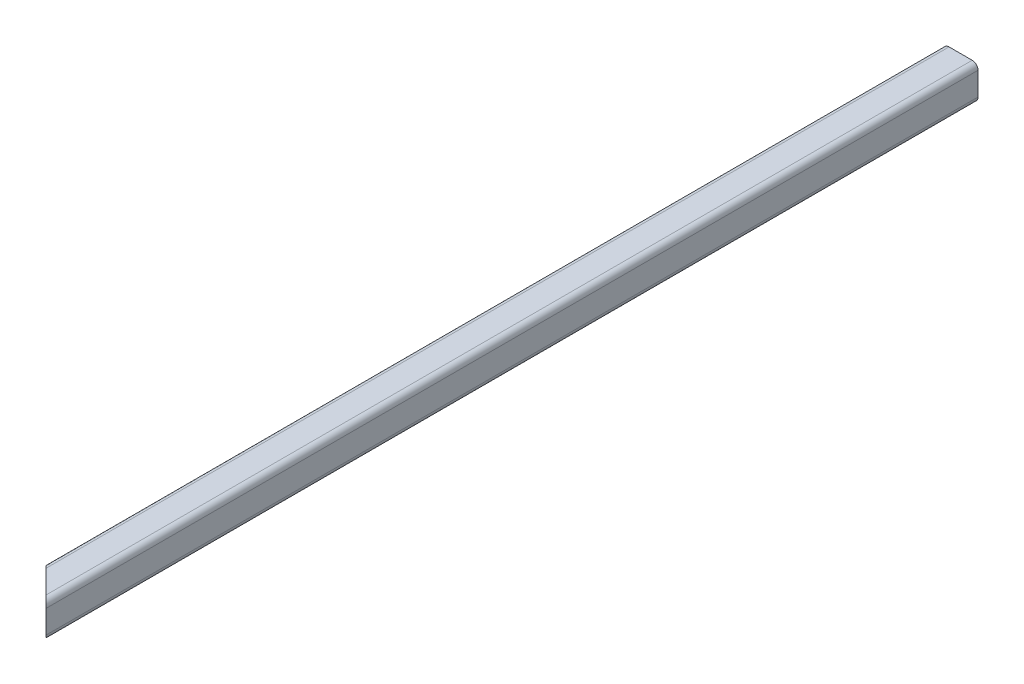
ISO-10303-21;
HEADER;
FILE_DESCRIPTION(('STEP AP214'),'2;1');
FILE_NAME('part.step','',(''),(''),'','','');
FILE_SCHEMA(('AUTOMOTIVE_DESIGN { 1 0 10303 214 1 1 1 1 }'));
ENDSEC;
DATA;
#1=APPLICATION_CONTEXT('core data for automotive mechanical design processes');
#2=APPLICATION_PROTOCOL_DEFINITION('international standard','automotive_design',2000,#1);
#3=PRODUCT_CONTEXT('',#1,'mechanical');
#4=PRODUCT('Part','Part','',(#3));
#5=PRODUCT_RELATED_PRODUCT_CATEGORY('part','',(#4));
#6=PRODUCT_DEFINITION_FORMATION('','',#4);
#7=PRODUCT_DEFINITION_CONTEXT('part definition',#1,'design');
#8=PRODUCT_DEFINITION('design','',#6,#7);
#9=PRODUCT_DEFINITION_SHAPE('','',#8);
#10=(LENGTH_UNIT() NAMED_UNIT(*) SI_UNIT(.MILLI.,.METRE.));
#11=(NAMED_UNIT(*) PLANE_ANGLE_UNIT() SI_UNIT($,.RADIAN.));
#12=(NAMED_UNIT(*) SI_UNIT($,.STERADIAN.) SOLID_ANGLE_UNIT());
#13=UNCERTAINTY_MEASURE_WITH_UNIT(LENGTH_MEASURE(1.E-05),#10,'distance_accuracy_value','');
#14=(GEOMETRIC_REPRESENTATION_CONTEXT(3) GLOBAL_UNCERTAINTY_ASSIGNED_CONTEXT((#13)) GLOBAL_UNIT_ASSIGNED_CONTEXT((#10,
#11,#12)) REPRESENTATION_CONTEXT('',''));
#15=CARTESIAN_POINT('',(0.,0.,0.));
#16=DIRECTION('',(0.,0.,1.));
#17=DIRECTION('',(1.,0.,0.));
#18=AXIS2_PLACEMENT_3D('',#15,#16,#17);
#19=CARTESIAN_POINT('',(20.,20.,0.));
#20=DIRECTION('',(0.,0.,1.));
#21=DIRECTION('',(1.,0.,0.));
#22=AXIS2_PLACEMENT_3D('',#19,#20,#21);
#23=PLANE('',#22);
#24=CARTESIAN_POINT('',(20.,20.,0.));
#25=DIRECTION('',(0.,0.,1.));
#26=DIRECTION('',(1.,0.,0.));
#27=AXIS2_PLACEMENT_3D('',#24,#25,#26);
#28=CIRCLE('',#27,10.);
#29=CARTESIAN_POINT('',(30.,20.,0.));
#30=VERTEX_POINT('',#29);
#31=CARTESIAN_POINT('',(20.,30.,0.));
#32=VERTEX_POINT('',#31);
#33=EDGE_CURVE('E193',#30,#32,#28,.T.);
#34=ORIENTED_EDGE('',*,*,#33,.F.);
#35=DIRECTION('',(0.,1.,0.));
#36=VECTOR('',#35,1.);
#37=CARTESIAN_POINT('',(30.,20.,0.));
#38=LINE('',#37,#36);
#39=CARTESIAN_POINT('',(30.,-20.,0.));
#40=VERTEX_POINT('',#39);
#41=EDGE_CURVE('E156',#40,#30,#38,.T.);
#42=ORIENTED_EDGE('',*,*,#41,.F.);
#43=CARTESIAN_POINT('',(20.,-20.,0.));
#44=DIRECTION('',(0.,0.,1.));
#45=DIRECTION('',(1.,0.,0.));
#46=AXIS2_PLACEMENT_3D('',#43,#44,#45);
#47=CIRCLE('',#46,10.);
#48=CARTESIAN_POINT('',(20.,-30.,0.));
#49=VERTEX_POINT('',#48);
#50=EDGE_CURVE('E212',#49,#40,#47,.T.);
#51=ORIENTED_EDGE('',*,*,#50,.F.);
#52=DIRECTION('',(1.,0.,0.));
#53=VECTOR('',#52,1.);
#54=CARTESIAN_POINT('',(-20.,-30.,0.));
#55=LINE('',#54,#53);
#56=CARTESIAN_POINT('',(-20.,-30.,0.));
#57=VERTEX_POINT('',#56);
#58=EDGE_CURVE('E210',#57,#49,#55,.T.);
#59=ORIENTED_EDGE('',*,*,#58,.F.);
#60=CARTESIAN_POINT('',(-20.,-20.,0.));
#61=DIRECTION('',(0.,0.,1.));
#62=DIRECTION('',(1.,0.,0.));
#63=AXIS2_PLACEMENT_3D('',#60,#61,#62);
#64=CIRCLE('',#63,10.);
#65=CARTESIAN_POINT('',(-30.,-20.,0.));
#66=VERTEX_POINT('',#65);
#67=EDGE_CURVE('E207',#66,#57,#64,.T.);
#68=ORIENTED_EDGE('',*,*,#67,.F.);
#69=DIRECTION('',(0.,-1.,0.));
#70=VECTOR('',#69,1.);
#71=CARTESIAN_POINT('',(-30.,-20.,0.));
#72=LINE('',#71,#70);
#73=CARTESIAN_POINT('',(-30.,20.,0.));
#74=VERTEX_POINT('',#73);
#75=EDGE_CURVE('E204',#74,#66,#72,.T.);
#76=ORIENTED_EDGE('',*,*,#75,.F.);
#77=CARTESIAN_POINT('',(-20.,20.,0.));
#78=DIRECTION('',(0.,0.,1.));
#79=DIRECTION('',(1.,0.,0.));
#80=AXIS2_PLACEMENT_3D('',#77,#78,#79);
#81=CIRCLE('',#80,10.);
#82=CARTESIAN_POINT('',(-20.,30.,0.));
#83=VERTEX_POINT('',#82);
#84=EDGE_CURVE('E196',#83,#74,#81,.T.);
#85=ORIENTED_EDGE('',*,*,#84,.F.);
#86=DIRECTION('',(-1.,0.,0.));
#87=VECTOR('',#86,1.);
#88=CARTESIAN_POINT('',(20.,30.,0.));
#89=LINE('',#88,#87);
#90=EDGE_CURVE('E188',#32,#83,#89,.T.);
#91=ORIENTED_EDGE('',*,*,#90,.F.);
#92=EDGE_LOOP('',(#34,#42,#51,#59,#68,#76,#85,#91));
#93=FACE_BOUND('',#92,.T.);
#94=CARTESIAN_POINT('',(-20.,20.,0.));
#95=DIRECTION('',(0.,0.,1.));
#96=DIRECTION('',(1.,0.,0.));
#97=AXIS2_PLACEMENT_3D('',#94,#95,#96);
#98=CIRCLE('',#97,5.00000000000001);
#99=CARTESIAN_POINT('',(-20.,25.,0.));
#100=VERTEX_POINT('',#99);
#101=CARTESIAN_POINT('',(-25.,20.,0.));
#102=VERTEX_POINT('',#101);
#103=EDGE_CURVE('E163',#100,#102,#98,.T.);
#104=ORIENTED_EDGE('',*,*,#103,.T.);
#105=DIRECTION('',(0.,-1.,0.));
#106=VECTOR('',#105,1.);
#107=CARTESIAN_POINT('',(-25.,-20.,0.));
#108=LINE('',#107,#106);
#109=CARTESIAN_POINT('',(-25.,-20.,0.));
#110=VERTEX_POINT('',#109);
#111=EDGE_CURVE('E243',#102,#110,#108,.T.);
#112=ORIENTED_EDGE('',*,*,#111,.T.);
#113=CARTESIAN_POINT('',(-20.,-20.,0.));
#114=DIRECTION('',(0.,0.,1.));
#115=DIRECTION('',(1.,0.,0.));
#116=AXIS2_PLACEMENT_3D('',#113,#114,#115);
#117=CIRCLE('',#116,5.);
#118=CARTESIAN_POINT('',(-20.,-25.,0.));
#119=VERTEX_POINT('',#118);
#120=EDGE_CURVE('E246',#110,#119,#117,.T.);
#121=ORIENTED_EDGE('',*,*,#120,.T.);
#122=DIRECTION('',(1.,0.,0.));
#123=VECTOR('',#122,1.);
#124=CARTESIAN_POINT('',(-20.,-25.,0.));
#125=LINE('',#124,#123);
#126=CARTESIAN_POINT('',(20.,-25.,0.));
#127=VERTEX_POINT('',#126);
#128=EDGE_CURVE('E249',#119,#127,#125,.T.);
#129=ORIENTED_EDGE('',*,*,#128,.T.);
#130=CARTESIAN_POINT('',(20.,-20.,0.));
#131=DIRECTION('',(0.,0.,1.));
#132=DIRECTION('',(1.,0.,0.));
#133=AXIS2_PLACEMENT_3D('',#130,#131,#132);
#134=CIRCLE('',#133,5.00000000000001);
#135=CARTESIAN_POINT('',(25.,-20.,0.));
#136=VERTEX_POINT('',#135);
#137=EDGE_CURVE('E252',#127,#136,#134,.T.);
#138=ORIENTED_EDGE('',*,*,#137,.T.);
#139=DIRECTION('',(0.,1.,0.));
#140=VECTOR('',#139,1.);
#141=CARTESIAN_POINT('',(25.,20.,0.));
#142=LINE('',#141,#140);
#143=CARTESIAN_POINT('',(25.,20.,0.));
#144=VERTEX_POINT('',#143);
#145=EDGE_CURVE('E255',#136,#144,#142,.T.);
#146=ORIENTED_EDGE('',*,*,#145,.T.);
#147=CARTESIAN_POINT('',(20.,20.,0.));
#148=DIRECTION('',(0.,0.,1.));
#149=DIRECTION('',(1.,0.,0.));
#150=AXIS2_PLACEMENT_3D('',#147,#148,#149);
#151=CIRCLE('',#150,5.00000000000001);
#152=CARTESIAN_POINT('',(20.,25.,0.));
#153=VERTEX_POINT('',#152);
#154=EDGE_CURVE('E258',#144,#153,#151,.T.);
#155=ORIENTED_EDGE('',*,*,#154,.T.);
#156=DIRECTION('',(-1.,0.,0.));
#157=VECTOR('',#156,1.);
#158=CARTESIAN_POINT('',(20.,25.,0.));
#159=LINE('',#158,#157);
#160=EDGE_CURVE('E261',#153,#100,#159,.T.);
#161=ORIENTED_EDGE('',*,*,#160,.T.);
#162=EDGE_LOOP('',(#104,#112,#121,#129,#138,#146,#155,#161));
#163=FACE_BOUND('',#162,.T.);
#164=ADVANCED_FACE('F32',(#93,#163),#23,.F.);
#165=CARTESIAN_POINT('',(20.,20.,1610.));
#166=DIRECTION('',(0.,0.,-1.));
#167=DIRECTION('',(-1.,0.,0.));
#168=AXIS2_PLACEMENT_3D('',#165,#166,#167);
#169=CYLINDRICAL_SURFACE('',#168,10.);
#170=DIRECTION('',(0.,0.,-1.));
#171=VECTOR('',#170,1.);
#172=CARTESIAN_POINT('',(20.,30.,1610.));
#173=LINE('',#172,#171);
#174=CARTESIAN_POINT('',(20.0000000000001,30.,1600.));
#175=VERTEX_POINT('',#174);
#176=EDGE_CURVE('E40',#175,#32,#173,.T.);
#177=ORIENTED_EDGE('',*,*,#176,.F.);
#178=CARTESIAN_POINT('',(20.,20.,1600.));
#179=DIRECTION('',(0.707106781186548,0.,-0.707106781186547));
#180=DIRECTION('',(-0.707106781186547,0.,-0.707106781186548));
#181=AXIS2_PLACEMENT_3D('',#178,#179,#180);
#182=ELLIPSE('',#181,14.142135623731,10.);
#183=CARTESIAN_POINT('',(30.,20.,1610.));
#184=VERTEX_POINT('',#183);
#185=EDGE_CURVE('E147',#175,#184,#182,.T.);
#186=ORIENTED_EDGE('',*,*,#185,.T.);
#187=DIRECTION('',(0.,0.,-1.));
#188=VECTOR('',#187,1.);
#189=CARTESIAN_POINT('',(30.,20.,1610.));
#190=LINE('',#189,#188);
#191=EDGE_CURVE('E155',#184,#30,#190,.T.);
#192=ORIENTED_EDGE('',*,*,#191,.T.);
#193=ORIENTED_EDGE('',*,*,#33,.T.);
#194=EDGE_LOOP('',(#177,#186,#192,#193));
#195=FACE_BOUND('',#194,.T.);
#196=ADVANCED_FACE('F34',(#195),#169,.T.);
#197=CARTESIAN_POINT('',(20.,30.,1610.));
#198=DIRECTION('',(0.,-1.,0.));
#199=DIRECTION('',(1.,0.,0.));
#200=AXIS2_PLACEMENT_3D('',#197,#198,#199);
#201=PLANE('',#200);
#202=DIRECTION('',(0.,0.,-1.));
#203=VECTOR('',#202,1.);
#204=CARTESIAN_POINT('',(-20.,30.,1610.));
#205=LINE('',#204,#203);
#206=CARTESIAN_POINT('',(-20.,30.,1560.));
#207=VERTEX_POINT('',#206);
#208=EDGE_CURVE('E182',#207,#83,#205,.T.);
#209=ORIENTED_EDGE('',*,*,#208,.F.);
#210=DIRECTION('',(-0.707106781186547,0.,-0.707106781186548));
#211=VECTOR('',#210,1.);
#212=CARTESIAN_POINT('',(-30.,30.,1550.));
#213=LINE('',#212,#211);
#214=EDGE_CURVE('E190',#175,#207,#213,.T.);
#215=ORIENTED_EDGE('',*,*,#214,.F.);
#216=ORIENTED_EDGE('',*,*,#176,.T.);
#217=ORIENTED_EDGE('',*,*,#90,.T.);
#218=EDGE_LOOP('',(#209,#215,#216,#217));
#219=FACE_BOUND('',#218,.T.);
#220=ADVANCED_FACE('F187',(#219),#201,.F.);
#221=CARTESIAN_POINT('',(-20.,20.,1610.));
#222=DIRECTION('',(0.,0.,-1.));
#223=DIRECTION('',(-1.,0.,0.));
#224=AXIS2_PLACEMENT_3D('',#221,#222,#223);
#225=CYLINDRICAL_SURFACE('',#224,10.);
#226=DIRECTION('',(0.,0.,-1.));
#227=VECTOR('',#226,1.);
#228=CARTESIAN_POINT('',(-30.,20.,1610.));
#229=LINE('',#228,#227);
#230=CARTESIAN_POINT('',(-30.,20.,1550.));
#231=VERTEX_POINT('',#230);
#232=EDGE_CURVE('E180',#231,#74,#229,.T.);
#233=ORIENTED_EDGE('',*,*,#232,.F.);
#234=CARTESIAN_POINT('',(-20.,20.,1560.));
#235=DIRECTION('',(0.707106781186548,0.,-0.707106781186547));
#236=DIRECTION('',(-0.707106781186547,0.,-0.707106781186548));
#237=AXIS2_PLACEMENT_3D('',#234,#235,#236);
#238=ELLIPSE('',#237,14.142135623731,10.);
#239=EDGE_CURVE('E164',#231,#207,#238,.T.);
#240=ORIENTED_EDGE('',*,*,#239,.T.);
#241=ORIENTED_EDGE('',*,*,#208,.T.);
#242=ORIENTED_EDGE('',*,*,#84,.T.);
#243=EDGE_LOOP('',(#233,#240,#241,#242));
#244=FACE_BOUND('',#243,.T.);
#245=ADVANCED_FACE('F236',(#244),#225,.T.);
#246=CARTESIAN_POINT('',(-30.,-20.,1610.));
#247=DIRECTION('',(1.,0.,0.));
#248=DIRECTION('',(0.,1.,0.));
#249=AXIS2_PLACEMENT_3D('',#246,#247,#248);
#250=PLANE('',#249);
#251=DIRECTION('',(0.,0.,-1.));
#252=VECTOR('',#251,1.);
#253=CARTESIAN_POINT('',(-30.,-20.,1610.));
#254=LINE('',#253,#252);
#255=CARTESIAN_POINT('',(-30.,-20.,1550.));
#256=VERTEX_POINT('',#255);
#257=EDGE_CURVE('E178',#256,#66,#254,.T.);
#258=ORIENTED_EDGE('',*,*,#257,.F.);
#259=DIRECTION('',(0.,1.,0.));
#260=VECTOR('',#259,1.);
#261=CARTESIAN_POINT('',(-30.,-30.,1550.));
#262=LINE('',#261,#260);
#263=EDGE_CURVE('E233',#256,#231,#262,.T.);
#264=ORIENTED_EDGE('',*,*,#263,.T.);
#265=ORIENTED_EDGE('',*,*,#232,.T.);
#266=ORIENTED_EDGE('',*,*,#75,.T.);
#267=EDGE_LOOP('',(#258,#264,#265,#266));
#268=FACE_BOUND('',#267,.T.);
#269=ADVANCED_FACE('F231',(#268),#250,.F.);
#270=CARTESIAN_POINT('',(-20.,-20.,1610.));
#271=DIRECTION('',(0.,0.,-1.));
#272=DIRECTION('',(-1.,0.,0.));
#273=AXIS2_PLACEMENT_3D('',#270,#271,#272);
#274=CYLINDRICAL_SURFACE('',#273,10.);
#275=DIRECTION('',(0.,0.,-1.));
#276=VECTOR('',#275,1.);
#277=CARTESIAN_POINT('',(-20.,-30.,1610.));
#278=LINE('',#277,#276);
#279=CARTESIAN_POINT('',(-20.,-30.,1560.));
#280=VERTEX_POINT('',#279);
#281=EDGE_CURVE('E176',#280,#57,#278,.T.);
#282=ORIENTED_EDGE('',*,*,#281,.F.);
#283=CARTESIAN_POINT('',(-20.,-20.,1560.));
#284=DIRECTION('',(0.707106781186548,0.,-0.707106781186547));
#285=DIRECTION('',(-0.707106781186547,0.,-0.707106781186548));
#286=AXIS2_PLACEMENT_3D('',#283,#284,#285);
#287=ELLIPSE('',#286,14.142135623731,10.);
#288=EDGE_CURVE('E228',#280,#256,#287,.T.);
#289=ORIENTED_EDGE('',*,*,#288,.T.);
#290=ORIENTED_EDGE('',*,*,#257,.T.);
#291=ORIENTED_EDGE('',*,*,#67,.T.);
#292=EDGE_LOOP('',(#282,#289,#290,#291));
#293=FACE_BOUND('',#292,.T.);
#294=ADVANCED_FACE('F226',(#293),#274,.T.);
#295=CARTESIAN_POINT('',(-20.,-30.,1610.));
#296=DIRECTION('',(0.,1.,0.));
#297=DIRECTION('',(-1.,0.,0.));
#298=AXIS2_PLACEMENT_3D('',#295,#296,#297);
#299=PLANE('',#298);
#300=DIRECTION('',(0.,0.,-1.));
#301=VECTOR('',#300,1.);
#302=CARTESIAN_POINT('',(20.,-30.,1610.));
#303=LINE('',#302,#301);
#304=CARTESIAN_POINT('',(20.,-30.,1600.));
#305=VERTEX_POINT('',#304);
#306=EDGE_CURVE('E170',#305,#49,#303,.T.);
#307=ORIENTED_EDGE('',*,*,#306,.F.);
#308=DIRECTION('',(-0.707106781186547,0.,-0.707106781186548));
#309=VECTOR('',#308,1.);
#310=CARTESIAN_POINT('',(-30.,-30.,1550.));
#311=LINE('',#310,#309);
#312=EDGE_CURVE('E223',#305,#280,#311,.T.);
#313=ORIENTED_EDGE('',*,*,#312,.T.);
#314=ORIENTED_EDGE('',*,*,#281,.T.);
#315=ORIENTED_EDGE('',*,*,#58,.T.);
#316=EDGE_LOOP('',(#307,#313,#314,#315));
#317=FACE_BOUND('',#316,.T.);
#318=ADVANCED_FACE('F220',(#317),#299,.F.);
#319=CARTESIAN_POINT('',(20.,-20.,1610.));
#320=DIRECTION('',(0.,0.,-1.));
#321=DIRECTION('',(-1.,0.,0.));
#322=AXIS2_PLACEMENT_3D('',#319,#320,#321);
#323=CYLINDRICAL_SURFACE('',#322,10.);
#324=DIRECTION('',(0.,0.,-1.));
#325=VECTOR('',#324,1.);
#326=CARTESIAN_POINT('',(30.,-20.,1610.));
#327=LINE('',#326,#325);
#328=CARTESIAN_POINT('',(30.,-20.,1610.));
#329=VERTEX_POINT('',#328);
#330=EDGE_CURVE('E168',#329,#40,#327,.T.);
#331=ORIENTED_EDGE('',*,*,#330,.F.);
#332=CARTESIAN_POINT('',(20.,-20.,1600.));
#333=DIRECTION('',(0.707106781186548,0.,-0.707106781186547));
#334=DIRECTION('',(-0.707106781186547,0.,-0.707106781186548));
#335=AXIS2_PLACEMENT_3D('',#332,#333,#334);
#336=ELLIPSE('',#335,14.142135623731,10.);
#337=EDGE_CURVE('E150',#329,#305,#336,.T.);
#338=ORIENTED_EDGE('',*,*,#337,.T.);
#339=ORIENTED_EDGE('',*,*,#306,.T.);
#340=ORIENTED_EDGE('',*,*,#50,.T.);
#341=EDGE_LOOP('',(#331,#338,#339,#340));
#342=FACE_BOUND('',#341,.T.);
#343=ADVANCED_FACE('F215',(#342),#323,.T.);
#344=CARTESIAN_POINT('',(30.,20.,1610.));
#345=DIRECTION('',(-1.,0.,0.));
#346=DIRECTION('',(0.,0.,1.));
#347=AXIS2_PLACEMENT_3D('',#344,#345,#346);
#348=PLANE('',#347);
#349=ORIENTED_EDGE('',*,*,#41,.T.);
#350=ORIENTED_EDGE('',*,*,#191,.F.);
#351=DIRECTION('',(0.,1.,0.));
#352=VECTOR('',#351,1.);
#353=CARTESIAN_POINT('',(30.,20.,1610.));
#354=LINE('',#353,#352);
#355=EDGE_CURVE('E144',#329,#184,#354,.T.);
#356=ORIENTED_EDGE('',*,*,#355,.F.);
#357=ORIENTED_EDGE('',*,*,#330,.T.);
#358=EDGE_LOOP('',(#349,#350,#356,#357));
#359=FACE_BOUND('',#358,.T.);
#360=ADVANCED_FACE('F166',(#359),#348,.F.);
#361=CARTESIAN_POINT('',(-20.,20.,1610.));
#362=DIRECTION('',(0.,0.,-1.));
#363=DIRECTION('',(-1.,0.,0.));
#364=AXIS2_PLACEMENT_3D('',#361,#362,#363);
#365=CYLINDRICAL_SURFACE('',#364,5.00000000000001);
#366=CARTESIAN_POINT('',(-20.,20.,1560.));
#367=DIRECTION('',(0.707106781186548,0.,-0.707106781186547));
#368=DIRECTION('',(-0.707106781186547,0.,-0.707106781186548));
#369=AXIS2_PLACEMENT_3D('',#366,#367,#368);
#370=ELLIPSE('',#369,7.07106781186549,5.00000000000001);
#371=CARTESIAN_POINT('',(-25.,20.,1555.));
#372=VERTEX_POINT('',#371);
#373=CARTESIAN_POINT('',(-20.,25.,1560.));
#374=VERTEX_POINT('',#373);
#375=EDGE_CURVE('E46',#372,#374,#370,.T.);
#376=ORIENTED_EDGE('',*,*,#375,.F.);
#377=DIRECTION('',(0.,0.,-1.));
#378=VECTOR('',#377,1.);
#379=CARTESIAN_POINT('',(-25.,20.,1610.));
#380=LINE('',#379,#378);
#381=EDGE_CURVE('E198',#372,#102,#380,.T.);
#382=ORIENTED_EDGE('',*,*,#381,.T.);
#383=ORIENTED_EDGE('',*,*,#103,.F.);
#384=DIRECTION('',(0.,0.,-1.));
#385=VECTOR('',#384,1.);
#386=CARTESIAN_POINT('',(-20.,25.,1610.));
#387=LINE('',#386,#385);
#388=EDGE_CURVE('E53',#374,#100,#387,.T.);
#389=ORIENTED_EDGE('',*,*,#388,.F.);
#390=EDGE_LOOP('',(#376,#382,#383,#389));
#391=FACE_BOUND('',#390,.T.);
#392=ADVANCED_FACE('F289',(#391),#365,.F.);
#393=CARTESIAN_POINT('',(-25.,-20.,1610.));
#394=DIRECTION('',(1.,0.,0.));
#395=DIRECTION('',(0.,1.,0.));
#396=AXIS2_PLACEMENT_3D('',#393,#394,#395);
#397=PLANE('',#396);
#398=DIRECTION('',(0.,1.,0.));
#399=VECTOR('',#398,1.);
#400=CARTESIAN_POINT('',(-25.,-20.,1555.));
#401=LINE('',#400,#399);
#402=CARTESIAN_POINT('',(-25.,-20.,1555.));
#403=VERTEX_POINT('',#402);
#404=EDGE_CURVE('E282',#403,#372,#401,.T.);
#405=ORIENTED_EDGE('',*,*,#404,.F.);
#406=DIRECTION('',(0.,0.,-1.));
#407=VECTOR('',#406,1.);
#408=CARTESIAN_POINT('',(-25.,-20.,1610.));
#409=LINE('',#408,#407);
#410=EDGE_CURVE('E200',#403,#110,#409,.T.);
#411=ORIENTED_EDGE('',*,*,#410,.T.);
#412=ORIENTED_EDGE('',*,*,#111,.F.);
#413=ORIENTED_EDGE('',*,*,#381,.F.);
#414=EDGE_LOOP('',(#405,#411,#412,#413));
#415=FACE_BOUND('',#414,.T.);
#416=ADVANCED_FACE('F280',(#415),#397,.T.);
#417=CARTESIAN_POINT('',(-20.,-20.,1610.));
#418=DIRECTION('',(0.,0.,-1.));
#419=DIRECTION('',(-1.,0.,0.));
#420=AXIS2_PLACEMENT_3D('',#417,#418,#419);
#421=CYLINDRICAL_SURFACE('',#420,5.);
#422=CARTESIAN_POINT('',(-20.,-20.,1560.));
#423=DIRECTION('',(0.707106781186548,0.,-0.707106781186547));
#424=DIRECTION('',(-0.707106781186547,0.,-0.707106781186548));
#425=AXIS2_PLACEMENT_3D('',#422,#423,#424);
#426=ELLIPSE('',#425,7.07106781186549,5.);
#427=CARTESIAN_POINT('',(-20.,-25.,1560.));
#428=VERTEX_POINT('',#427);
#429=EDGE_CURVE('E291',#428,#403,#426,.T.);
#430=ORIENTED_EDGE('',*,*,#429,.F.);
#431=DIRECTION('',(0.,0.,-1.));
#432=VECTOR('',#431,1.);
#433=CARTESIAN_POINT('',(-20.,-25.,1610.));
#434=LINE('',#433,#432);
#435=EDGE_CURVE('E273',#428,#119,#434,.T.);
#436=ORIENTED_EDGE('',*,*,#435,.T.);
#437=ORIENTED_EDGE('',*,*,#120,.F.);
#438=ORIENTED_EDGE('',*,*,#410,.F.);
#439=EDGE_LOOP('',(#430,#436,#437,#438));
#440=FACE_BOUND('',#439,.T.);
#441=ADVANCED_FACE('F285',(#440),#421,.F.);
#442=CARTESIAN_POINT('',(-20.,-25.,1610.));
#443=DIRECTION('',(0.,1.,0.));
#444=DIRECTION('',(-1.,0.,0.));
#445=AXIS2_PLACEMENT_3D('',#442,#443,#444);
#446=PLANE('',#445);
#447=DIRECTION('',(-0.707106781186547,0.,-0.707106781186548));
#448=VECTOR('',#447,1.);
#449=CARTESIAN_POINT('',(5.00000000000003,-25.,1585.));
#450=LINE('',#449,#448);
#451=CARTESIAN_POINT('',(20.,-25.,1600.));
#452=VERTEX_POINT('',#451);
#453=EDGE_CURVE('E295',#452,#428,#450,.T.);
#454=ORIENTED_EDGE('',*,*,#453,.F.);
#455=DIRECTION('',(0.,0.,-1.));
#456=VECTOR('',#455,1.);
#457=CARTESIAN_POINT('',(20.,-25.,1610.));
#458=LINE('',#457,#456);
#459=EDGE_CURVE('E271',#452,#127,#458,.T.);
#460=ORIENTED_EDGE('',*,*,#459,.T.);
#461=ORIENTED_EDGE('',*,*,#128,.F.);
#462=ORIENTED_EDGE('',*,*,#435,.F.);
#463=EDGE_LOOP('',(#454,#460,#461,#462));
#464=FACE_BOUND('',#463,.T.);
#465=ADVANCED_FACE('F323',(#464),#446,.T.);
#466=CARTESIAN_POINT('',(20.,-20.,1610.));
#467=DIRECTION('',(0.,0.,-1.));
#468=DIRECTION('',(-1.,0.,0.));
#469=AXIS2_PLACEMENT_3D('',#466,#467,#468);
#470=CYLINDRICAL_SURFACE('',#469,5.00000000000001);
#471=CARTESIAN_POINT('',(20.,-20.,1600.));
#472=DIRECTION('',(0.707106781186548,0.,-0.707106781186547));
#473=DIRECTION('',(-0.707106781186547,0.,-0.707106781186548));
#474=AXIS2_PLACEMENT_3D('',#471,#472,#473);
#475=ELLIPSE('',#474,7.07106781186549,5.00000000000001);
#476=CARTESIAN_POINT('',(25.,-20.,1605.));
#477=VERTEX_POINT('',#476);
#478=EDGE_CURVE('E297',#477,#452,#475,.T.);
#479=ORIENTED_EDGE('',*,*,#478,.F.);
#480=DIRECTION('',(0.,0.,-1.));
#481=VECTOR('',#480,1.);
#482=CARTESIAN_POINT('',(25.,-20.,1610.));
#483=LINE('',#482,#481);
#484=EDGE_CURVE('E269',#477,#136,#483,.T.);
#485=ORIENTED_EDGE('',*,*,#484,.T.);
#486=ORIENTED_EDGE('',*,*,#137,.F.);
#487=ORIENTED_EDGE('',*,*,#459,.F.);
#488=EDGE_LOOP('',(#479,#485,#486,#487));
#489=FACE_BOUND('',#488,.T.);
#490=ADVANCED_FACE('F320',(#489),#470,.F.);
#491=CARTESIAN_POINT('',(25.,20.,1610.));
#492=DIRECTION('',(-1.,0.,0.));
#493=DIRECTION('',(0.,0.,1.));
#494=AXIS2_PLACEMENT_3D('',#491,#492,#493);
#495=PLANE('',#494);
#496=DIRECTION('',(0.,-1.,0.));
#497=VECTOR('',#496,1.);
#498=CARTESIAN_POINT('',(25.,20.,1605.));
#499=LINE('',#498,#497);
#500=CARTESIAN_POINT('',(25.,20.,1605.));
#501=VERTEX_POINT('',#500);
#502=EDGE_CURVE('E299',#501,#477,#499,.T.);
#503=ORIENTED_EDGE('',*,*,#502,.F.);
#504=DIRECTION('',(0.,0.,-1.));
#505=VECTOR('',#504,1.);
#506=CARTESIAN_POINT('',(25.,20.,1610.));
#507=LINE('',#506,#505);
#508=EDGE_CURVE('E267',#501,#144,#507,.T.);
#509=ORIENTED_EDGE('',*,*,#508,.T.);
#510=ORIENTED_EDGE('',*,*,#145,.F.);
#511=ORIENTED_EDGE('',*,*,#484,.F.);
#512=EDGE_LOOP('',(#503,#509,#510,#511));
#513=FACE_BOUND('',#512,.T.);
#514=ADVANCED_FACE('F313',(#513),#495,.T.);
#515=CARTESIAN_POINT('',(20.,20.,1610.));
#516=DIRECTION('',(0.,0.,-1.));
#517=DIRECTION('',(-1.,0.,0.));
#518=AXIS2_PLACEMENT_3D('',#515,#516,#517);
#519=CYLINDRICAL_SURFACE('',#518,5.00000000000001);
#520=CARTESIAN_POINT('',(20.,20.,1600.));
#521=DIRECTION('',(0.707106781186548,0.,-0.707106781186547));
#522=DIRECTION('',(-0.707106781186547,0.,-0.707106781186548));
#523=AXIS2_PLACEMENT_3D('',#520,#521,#522);
#524=ELLIPSE('',#523,7.07106781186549,5.00000000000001);
#525=CARTESIAN_POINT('',(20.,25.,1600.));
#526=VERTEX_POINT('',#525);
#527=EDGE_CURVE('E301',#526,#501,#524,.T.);
#528=ORIENTED_EDGE('',*,*,#527,.F.);
#529=DIRECTION('',(0.,0.,-1.));
#530=VECTOR('',#529,1.);
#531=CARTESIAN_POINT('',(20.,25.,1610.));
#532=LINE('',#531,#530);
#533=EDGE_CURVE('E265',#526,#153,#532,.T.);
#534=ORIENTED_EDGE('',*,*,#533,.T.);
#535=ORIENTED_EDGE('',*,*,#154,.F.);
#536=ORIENTED_EDGE('',*,*,#508,.F.);
#537=EDGE_LOOP('',(#528,#534,#535,#536));
#538=FACE_BOUND('',#537,.T.);
#539=ADVANCED_FACE('F316',(#538),#519,.F.);
#540=CARTESIAN_POINT('',(20.,25.,1610.));
#541=DIRECTION('',(0.,-1.,0.));
#542=DIRECTION('',(1.,0.,0.));
#543=AXIS2_PLACEMENT_3D('',#540,#541,#542);
#544=PLANE('',#543);
#545=DIRECTION('',(0.707106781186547,0.,0.707106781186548));
#546=VECTOR('',#545,1.);
#547=CARTESIAN_POINT('',(25.,25.,1605.));
#548=LINE('',#547,#546);
#549=EDGE_CURVE('E11',#374,#526,#548,.T.);
#550=ORIENTED_EDGE('',*,*,#549,.F.);
#551=ORIENTED_EDGE('',*,*,#388,.T.);
#552=ORIENTED_EDGE('',*,*,#160,.F.);
#553=ORIENTED_EDGE('',*,*,#533,.F.);
#554=EDGE_LOOP('',(#550,#551,#552,#553));
#555=FACE_BOUND('',#554,.T.);
#556=ADVANCED_FACE('F421',(#555),#544,.T.);
#557=CARTESIAN_POINT('',(-30.,-30.,1550.));
#558=DIRECTION('',(0.707106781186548,0.,-0.707106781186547));
#559=DIRECTION('',(-0.707106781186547,0.,-0.707106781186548));
#560=AXIS2_PLACEMENT_3D('',#557,#558,#559);
#561=PLANE('',#560);
#562=ORIENTED_EDGE('',*,*,#375,.T.);
#563=ORIENTED_EDGE('',*,*,#549,.T.);
#564=ORIENTED_EDGE('',*,*,#527,.T.);
#565=ORIENTED_EDGE('',*,*,#502,.T.);
#566=ORIENTED_EDGE('',*,*,#478,.T.);
#567=ORIENTED_EDGE('',*,*,#453,.T.);
#568=ORIENTED_EDGE('',*,*,#429,.T.);
#569=ORIENTED_EDGE('',*,*,#404,.T.);
#570=EDGE_LOOP('',(#562,#563,#564,#565,#566,#567,#568,#569));
#571=FACE_BOUND('',#570,.T.);
#572=ORIENTED_EDGE('',*,*,#214,.T.);
#573=ORIENTED_EDGE('',*,*,#239,.F.);
#574=ORIENTED_EDGE('',*,*,#263,.F.);
#575=ORIENTED_EDGE('',*,*,#288,.F.);
#576=ORIENTED_EDGE('',*,*,#312,.F.);
#577=ORIENTED_EDGE('',*,*,#337,.F.);
#578=ORIENTED_EDGE('',*,*,#355,.T.);
#579=ORIENTED_EDGE('',*,*,#185,.F.);
#580=EDGE_LOOP('',(#572,#573,#574,#575,#576,#577,#578,#579));
#581=FACE_BOUND('',#580,.T.);
#582=ADVANCED_FACE('F146',(#571,#581),#561,.F.);
#583=CLOSED_SHELL('',(#164,#196,#220,#245,#269,#294,#318,#343,#360,#392,#416,#441,#465,#490,
#514,#539,#556,#582));
#584=MANIFOLD_SOLID_BREP('B2',#583);
#585=ADVANCED_BREP_SHAPE_REPRESENTATION('',(#18,#584),#14);
#586=SHAPE_DEFINITION_REPRESENTATION(#9,#585);
ENDSEC;
END-ISO-10303-21;
